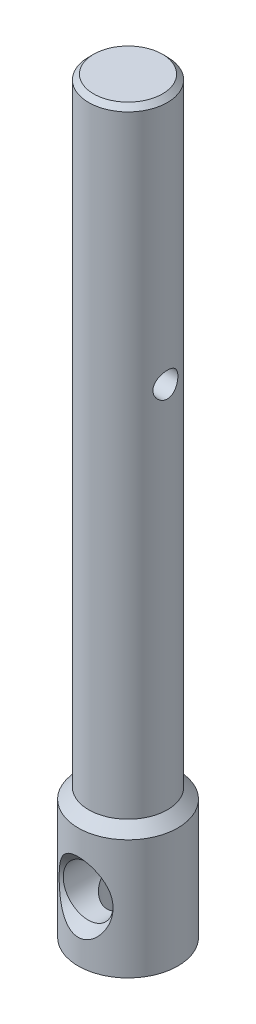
ISO-10303-21;
HEADER;
FILE_DESCRIPTION(('STEP AP214'),'2;1');
FILE_NAME('part.step','',(''),(''),'','','');
FILE_SCHEMA(('AUTOMOTIVE_DESIGN { 1 0 10303 214 1 1 1 1 }'));
ENDSEC;
DATA;
#1=APPLICATION_CONTEXT('core data for automotive mechanical design processes');
#2=APPLICATION_PROTOCOL_DEFINITION('international standard','automotive_design',2000,#1);
#3=PRODUCT_CONTEXT('',#1,'mechanical');
#4=PRODUCT('Part','Part','',(#3));
#5=PRODUCT_RELATED_PRODUCT_CATEGORY('part','',(#4));
#6=PRODUCT_DEFINITION_FORMATION('','',#4);
#7=PRODUCT_DEFINITION_CONTEXT('part definition',#1,'design');
#8=PRODUCT_DEFINITION('design','',#6,#7);
#9=PRODUCT_DEFINITION_SHAPE('','',#8);
#10=(LENGTH_UNIT() NAMED_UNIT(*) SI_UNIT(.MILLI.,.METRE.));
#11=(NAMED_UNIT(*) PLANE_ANGLE_UNIT() SI_UNIT($,.RADIAN.));
#12=(NAMED_UNIT(*) SI_UNIT($,.STERADIAN.) SOLID_ANGLE_UNIT());
#13=UNCERTAINTY_MEASURE_WITH_UNIT(LENGTH_MEASURE(1.E-05),#10,'distance_accuracy_value','');
#14=(GEOMETRIC_REPRESENTATION_CONTEXT(3) GLOBAL_UNCERTAINTY_ASSIGNED_CONTEXT((#13)) GLOBAL_UNIT_ASSIGNED_CONTEXT((#10,
#11,#12)) REPRESENTATION_CONTEXT('',''));
#15=CARTESIAN_POINT('',(0.,0.,0.));
#16=DIRECTION('',(0.,0.,1.));
#17=DIRECTION('',(1.,0.,0.));
#18=AXIS2_PLACEMENT_3D('',#15,#16,#17);
#19=CARTESIAN_POINT('',(0.,0.,0.));
#20=DIRECTION('',(0.,1.,0.));
#21=DIRECTION('',(0.,0.,1.));
#22=AXIS2_PLACEMENT_3D('',#19,#20,#21);
#23=PLANE('',#22);
#24=CARTESIAN_POINT('',(0.,0.,0.));
#25=DIRECTION('',(0.,-1.,0.));
#26=DIRECTION('',(0.,0.,-1.));
#27=AXIS2_PLACEMENT_3D('',#24,#25,#26);
#28=CIRCLE('',#27,5.);
#29=CARTESIAN_POINT('',(0.,0.,-5.));
#30=VERTEX_POINT('',#29);
#31=EDGE_CURVE('E85',#30,#30,#28,.T.);
#32=ORIENTED_EDGE('',*,*,#31,.T.);
#33=EDGE_LOOP('',(#32));
#34=FACE_BOUND('',#33,.T.);
#35=CARTESIAN_POINT('',(0.,0.,0.));
#36=DIRECTION('',(0.,-1.,0.));
#37=DIRECTION('',(0.,0.,-1.));
#38=AXIS2_PLACEMENT_3D('',#35,#36,#37);
#39=CIRCLE('',#38,2.09999999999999);
#40=CARTESIAN_POINT('',(0.,0.,-2.09999999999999));
#41=VERTEX_POINT('',#40);
#42=EDGE_CURVE('E69',#41,#41,#39,.T.);
#43=ORIENTED_EDGE('',*,*,#42,.F.);
#44=EDGE_LOOP('',(#43));
#45=FACE_BOUND('',#44,.T.);
#46=ADVANCED_FACE('F43',(#34,#45),#23,.F.);
#47=CARTESIAN_POINT('',(0.,0.,0.));
#48=DIRECTION('',(0.,-1.,0.));
#49=DIRECTION('',(0.,0.,-1.));
#50=AXIS2_PLACEMENT_3D('',#47,#48,#49);
#51=CYLINDRICAL_SURFACE('',#50,5.);
#52=CARTESIAN_POINT('',(-2.04163136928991,3.7150619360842,-4.56418024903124));
#53=CARTESIAN_POINT('',(-2.15834877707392,3.88935210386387,-4.51197567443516));
#54=CARTESIAN_POINT('',(-2.25954266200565,4.07465214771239,-4.46137897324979));
#55=CARTESIAN_POINT('',(-2.43157280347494,4.46145756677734,-4.37001026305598));
#56=CARTESIAN_POINT('',(-2.5023525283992,4.66299229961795,-4.3292566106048));
#57=CARTESIAN_POINT('',(-2.58559109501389,4.97395121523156,-4.27968824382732));
#58=CARTESIAN_POINT('',(-2.6095662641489,5.07950064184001,-4.26505635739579));
#59=CARTESIAN_POINT('',(-2.64960604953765,5.29259640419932,-4.24030116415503));
#60=CARTESIAN_POINT('',(-2.66567369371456,5.40014195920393,-4.23017613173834));
#61=CARTESIAN_POINT('',(-2.68981267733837,5.61636003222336,-4.2148677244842));
#62=CARTESIAN_POINT('',(-2.69789217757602,5.72503128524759,-4.20967930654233));
#63=CARTESIAN_POINT('',(-2.70603661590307,5.94279720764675,-4.20444890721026));
#64=CARTESIAN_POINT('',(-2.70610181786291,6.05189186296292,-4.20440675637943));
#65=CARTESIAN_POINT('',(-2.69830455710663,6.26726388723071,-4.20941471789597));
#66=CARTESIAN_POINT('',(-2.69061705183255,6.37355028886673,-4.21435244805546));
#67=CARTESIAN_POINT('',(-2.66762262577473,6.58496519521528,-4.22894474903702));
#68=CARTESIAN_POINT('',(-2.65231565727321,6.69009369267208,-4.23859934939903));
#69=CARTESIAN_POINT('',(-2.61413520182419,6.89857712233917,-4.26225327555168));
#70=CARTESIAN_POINT('',(-2.59125461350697,7.00193029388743,-4.2762566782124));
#71=CARTESIAN_POINT('',(-2.53800564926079,7.20610268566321,-4.30807143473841));
#72=CARTESIAN_POINT('',(-2.50763443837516,7.30692093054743,-4.32588422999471));
#73=CARTESIAN_POINT('',(-2.40468658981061,7.60659915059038,-4.38449877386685));
#74=CARTESIAN_POINT('',(-2.32063374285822,7.80070607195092,-4.4302336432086));
#75=CARTESIAN_POINT('',(-2.12205531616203,8.17061846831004,-4.52870122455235));
#76=CARTESIAN_POINT('',(-2.00755558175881,8.34643929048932,-4.58142798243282));
#77=CARTESIAN_POINT('',(-1.78164962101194,8.62969628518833,-4.67293984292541));
#78=CARTESIAN_POINT('',(-1.67747535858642,8.74290263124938,-4.7117140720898));
#79=CARTESIAN_POINT('',(-1.45178944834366,8.95172314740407,-4.78605945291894));
#80=CARTESIAN_POINT('',(-1.33030905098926,9.04736833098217,-4.82163619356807));
#81=CARTESIAN_POINT('',(-1.09918657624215,9.19718724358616,-4.87879781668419));
#82=CARTESIAN_POINT('',(-0.99280972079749,9.25585560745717,-4.90173939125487));
#83=CARTESIAN_POINT('',(-0.771144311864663,9.35608578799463,-4.94145451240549));
#84=CARTESIAN_POINT('',(-0.655862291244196,9.39766000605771,-4.95823252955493));
#85=CARTESIAN_POINT('',(-0.418028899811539,9.46094716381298,-4.9839381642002));
#86=CARTESIAN_POINT('',(-0.295427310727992,9.48250066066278,-4.99280273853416));
#87=CARTESIAN_POINT('',(-0.0480419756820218,9.50316033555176,-5.0012969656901));
#88=CARTESIAN_POINT('',(0.0767403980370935,9.50228015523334,-5.0009322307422));
#89=CARTESIAN_POINT('',(0.308404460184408,9.47971270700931,-4.99165917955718));
#90=CARTESIAN_POINT('',(0.415594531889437,9.46060713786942,-4.9838109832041));
#91=CARTESIAN_POINT('',(0.625236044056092,9.40665046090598,-4.96187510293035));
#92=CARTESIAN_POINT('',(0.727685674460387,9.37179339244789,-4.94778505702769));
#93=CARTESIAN_POINT('',(0.953679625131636,9.27663730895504,-4.9098922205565));
#94=CARTESIAN_POINT('',(1.07509872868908,9.21194739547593,-4.88447453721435));
#95=CARTESIAN_POINT('',(1.30503445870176,9.06453402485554,-4.82814438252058));
#96=CARTESIAN_POINT('',(1.41352625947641,8.98177670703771,-4.79722161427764));
#97=CARTESIAN_POINT('',(1.65141008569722,8.77173068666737,-4.72157414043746));
#98=CARTESIAN_POINT('',(1.77548105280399,8.63884290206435,-4.67571587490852));
#99=CARTESIAN_POINT('',(1.99994383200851,8.35443240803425,-4.58420674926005));
#100=CARTESIAN_POINT('',(2.1003084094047,8.20288856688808,-4.53855618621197));
#101=CARTESIAN_POINT('',(2.28012888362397,7.88200283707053,-4.45098071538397));
#102=CARTESIAN_POINT('',(2.35904236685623,7.71232820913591,-4.40916757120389));
#103=CARTESIAN_POINT('',(2.49303182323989,7.36188827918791,-4.33482328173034));
#104=CARTESIAN_POINT('',(2.54811448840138,7.18112610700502,-4.30228953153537));
#105=CARTESIAN_POINT('',(2.61589500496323,6.89054070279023,-4.26120893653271));
#106=CARTESIAN_POINT('',(2.63666162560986,6.78313321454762,-4.24834030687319));
#107=CARTESIAN_POINT('',(2.67012149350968,6.56657296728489,-4.22739287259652));
#108=CARTESIAN_POINT('',(2.68281410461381,6.45742007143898,-4.21931444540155));
#109=CARTESIAN_POINT('',(2.70004351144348,6.23824121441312,-4.20830941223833));
#110=CARTESIAN_POINT('',(2.70458206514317,6.12821544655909,-4.20538169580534));
#111=CARTESIAN_POINT('',(2.70548116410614,5.9081197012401,-4.20480354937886));
#112=CARTESIAN_POINT('',(2.70184212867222,5.79804972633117,-4.20715284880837));
#113=CARTESIAN_POINT('',(2.6866874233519,5.58265750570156,-4.21684557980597));
#114=CARTESIAN_POINT('',(2.67545904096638,5.47730660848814,-4.22400680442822));
#115=CARTESIAN_POINT('',(2.64547849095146,5.26805358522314,-4.24284761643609));
#116=CARTESIAN_POINT('',(2.62672349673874,5.16415201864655,-4.25452890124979));
#117=CARTESIAN_POINT('',(2.58174852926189,4.95844473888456,-4.28197033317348));
#118=CARTESIAN_POINT('',(2.55552328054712,4.85664056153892,-4.2977333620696));
#119=CARTESIAN_POINT('',(2.49567830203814,4.65583387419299,-4.33275692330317));
#120=CARTESIAN_POINT('',(2.46205579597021,4.55683243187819,-4.35201876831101));
#121=CARTESIAN_POINT('',(2.34855505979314,4.2607965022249,-4.41496879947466));
#122=CARTESIAN_POINT('',(2.25697230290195,4.06904843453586,-4.46320344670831));
#123=CARTESIAN_POINT('',(2.04274496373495,3.70551411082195,-4.56522008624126));
#124=CARTESIAN_POINT('',(1.9201401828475,3.53370268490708,-4.61899491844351));
#125=CARTESIAN_POINT('',(1.68487427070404,3.26558247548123,-4.70870120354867));
#126=CARTESIAN_POINT('',(1.58047477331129,3.16217838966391,-4.74509798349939));
#127=CARTESIAN_POINT('',(1.35591257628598,2.97264719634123,-4.81406670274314));
#128=CARTESIAN_POINT('',(1.23577776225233,2.88649019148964,-4.84664521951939));
#129=CARTESIAN_POINT('',(1.00646995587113,2.7516115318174,-4.89876537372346));
#130=CARTESIAN_POINT('',(0.899988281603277,2.69884323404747,-4.91961111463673));
#131=CARTESIAN_POINT('',(0.679091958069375,2.61043320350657,-4.95492713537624));
#132=CARTESIAN_POINT('',(0.564683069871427,2.57477917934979,-4.96940199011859));
#133=CARTESIAN_POINT('',(0.329913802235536,2.52304964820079,-4.99050246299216));
#134=CARTESIAN_POINT('',(0.209518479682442,2.50710784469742,-4.99707446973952));
#135=CARTESIAN_POINT('',(-0.0323400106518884,2.49670505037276,-5.00135579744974));
#136=CARTESIAN_POINT('',(-0.153802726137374,2.50223536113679,-4.9990687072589));
#137=CARTESIAN_POINT('',(-0.380598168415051,2.53250553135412,-4.98664954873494));
#138=CARTESIAN_POINT('',(-0.486271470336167,2.55513766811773,-4.97737857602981));
#139=CARTESIAN_POINT('',(-0.692458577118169,2.61555268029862,-4.9529082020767));
#140=CARTESIAN_POINT('',(-0.792969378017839,2.65334426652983,-4.93770539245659));
#141=CARTESIAN_POINT('',(-1.0183803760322,2.75633132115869,-4.89692827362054));
#142=CARTESIAN_POINT('',(-1.14071424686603,2.82643233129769,-4.86959065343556));
#143=CARTESIAN_POINT('',(-1.37152468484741,2.98474135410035,-4.80969938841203));
#144=CARTESIAN_POINT('',(-1.47998405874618,3.07297148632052,-4.77713938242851));
#145=CARTESIAN_POINT('',(-1.66846180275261,3.25019014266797,-4.71430483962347));
#146=CARTESIAN_POINT('',(-1.75033635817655,3.337346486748,-4.68434762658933));
#147=CARTESIAN_POINT('',(-1.90369368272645,3.52016737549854,-4.62414658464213));
#148=CARTESIAN_POINT('',(-1.97517855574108,3.61583019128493,-4.5939028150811));
#149=CARTESIAN_POINT('',(-2.04163136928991,3.7150619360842,-4.56418024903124));
#150=B_SPLINE_CURVE_WITH_KNOTS('',3,(#52,#53,#54,#55,#56,#57,#58,#59,#60,#61,#62,#63,#64,#65,
#66,#67,#68,#69,#70,#71,#72,#73,#74,#75,#76,#77,#78,#79,#80,#81,#82,#83,#84,#85,#86,#87,#88,#89,
#90,#91,#92,#93,#94,#95,#96,#97,#98,#99,#100,#101,#102,#103,#104,#105,#106,#107,#108,#109,#110,
#111,#112,#113,#114,#115,#116,#117,#118,#119,#120,#121,#122,#123,#124,#125,#126,#127,#128,#129,
#130,#131,#132,#133,#134,#135,#136,#137,#138,#139,#140,#141,#142,#143,#144,#145,#146,#147,#148,
#149),.UNSPECIFIED.,.T.,.F.,(4,2,2,2,2,2,2,2,2,2,2,2,2,2,2,2,2,2,2,2,2,2,2,2,2,2,2,2,2,2,2,2,2,
2,2,2,2,2,2,2,2,2,2,2,2,2,2,2,4),(0.,0.64804458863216,1.29728855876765,1.62462305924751,
1.95183212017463,2.27870655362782,2.60557022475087,2.92521895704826,3.24486969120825,
3.56482099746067,3.88489358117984,4.53103621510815,5.17663210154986,5.65102181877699,
6.12456551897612,6.4940434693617,6.86325289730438,7.23537807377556,7.60727697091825,
7.93327114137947,8.25938877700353,8.67681646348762,9.09503328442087,9.65453396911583,
10.2146743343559,10.7878824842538,11.3609295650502,11.6910244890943,12.0211454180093,
12.351195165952,12.6812279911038,12.9994196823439,13.317730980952,13.6362676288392,
13.9549240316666,14.6054574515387,15.255160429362,15.7078183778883,16.1596847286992,
16.5202304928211,16.8805169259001,17.2432339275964,17.6058040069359,17.9297749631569,
18.2539323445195,18.6824551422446,19.1115039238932,19.4805415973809,19.849504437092),.UNSPECIFIED.);
#151=CARTESIAN_POINT('',(-2.04163136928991,3.7150619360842,-4.56418024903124));
#152=VERTEX_POINT('',#151);
#153=EDGE_CURVE('E88',#152,#152,#150,.T.);
#154=ORIENTED_EDGE('',*,*,#153,.F.);
#155=EDGE_LOOP('',(#154));
#156=FACE_BOUND('',#155,.T.);
#157=CARTESIAN_POINT('',(0.,12.,0.));
#158=DIRECTION('',(0.,-1.,0.));
#159=DIRECTION('',(0.,0.,-1.));
#160=AXIS2_PLACEMENT_3D('',#157,#158,#159);
#161=CIRCLE('',#160,5.);
#162=CARTESIAN_POINT('',(0.,12.,-5.));
#163=VERTEX_POINT('',#162);
#164=EDGE_CURVE('E82',#163,#163,#161,.T.);
#165=ORIENTED_EDGE('',*,*,#164,.T.);
#166=EDGE_LOOP('',(#165));
#167=FACE_BOUND('',#166,.T.);
#168=ORIENTED_EDGE('',*,*,#31,.F.);
#169=EDGE_LOOP('',(#168));
#170=FACE_BOUND('',#169,.T.);
#171=CARTESIAN_POINT('',(-2.04163136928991,3.7150619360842,4.56418024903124));
#172=CARTESIAN_POINT('',(-1.9599859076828,3.59312932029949,4.60070439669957));
#173=CARTESIAN_POINT('',(-1.87063178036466,3.47644884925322,4.63805560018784));
#174=CARTESIAN_POINT('',(-1.6760621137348,3.25644395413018,4.71186217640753));
#175=CARTESIAN_POINT('',(-1.5708278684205,3.15313555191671,4.74831643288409));
#176=CARTESIAN_POINT('',(-1.35827933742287,2.97551638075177,4.81309255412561));
#177=CARTESIAN_POINT('',(-1.25279079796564,2.89920477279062,4.84186382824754));
#178=CARTESIAN_POINT('',(-1.03021210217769,2.76357581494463,4.89404382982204));
#179=CARTESIAN_POINT('',(-0.913140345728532,2.7042320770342,4.9174608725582));
#180=CARTESIAN_POINT('',(-0.688079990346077,2.61392651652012,4.95352972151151));
#181=CARTESIAN_POINT('',(-0.581465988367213,2.58000242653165,4.96728361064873));
#182=CARTESIAN_POINT('',(-0.36358480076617,2.5292577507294,4.9879601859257));
#183=CARTESIAN_POINT('',(-0.25232050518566,2.51242670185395,4.99488705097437));
#184=CARTESIAN_POINT('',(-0.0279967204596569,2.49712105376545,5.00118329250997));
#185=CARTESIAN_POINT('',(0.0850668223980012,2.4986964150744,5.00053209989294));
#186=CARTESIAN_POINT('',(0.309128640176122,2.52019657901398,4.99169537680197));
#187=CARTESIAN_POINT('',(0.420126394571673,2.54012594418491,4.983507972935));
#188=CARTESIAN_POINT('',(0.632901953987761,2.5957734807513,4.96089476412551));
#189=CARTESIAN_POINT('',(0.734868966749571,2.63087974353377,4.94671116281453));
#190=CARTESIAN_POINT('',(0.932137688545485,2.71466876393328,4.91336433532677));
#191=CARTESIAN_POINT('',(1.027436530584,2.76335731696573,4.89419898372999));
#192=CARTESIAN_POINT('',(1.25185735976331,2.89689002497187,4.84267059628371));
#193=CARTESIAN_POINT('',(1.37671824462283,2.98811726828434,4.80826404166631));
#194=CARTESIAN_POINT('',(1.60927689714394,3.18908646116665,4.73552102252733));
#195=CARTESIAN_POINT('',(1.71693233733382,3.29887274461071,4.69717523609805));
#196=CARTESIAN_POINT('',(1.94603175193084,3.56903613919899,4.60786612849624));
#197=CARTESIAN_POINT('',(2.06135649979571,3.73453004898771,4.55668652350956));
#198=CARTESIAN_POINT('',(2.26364993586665,4.08329094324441,4.45964972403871));
#199=CARTESIAN_POINT('',(2.35060034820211,4.26656928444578,4.41379597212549));
#200=CARTESIAN_POINT('',(2.49748722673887,4.64880968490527,4.3324060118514));
#201=CARTESIAN_POINT('',(2.55705748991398,4.84794478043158,4.29701180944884));
#202=CARTESIAN_POINT('',(2.62449724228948,5.15284134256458,4.25589790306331));
#203=CARTESIAN_POINT('',(2.6433251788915,5.25551426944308,4.24418904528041));
#204=CARTESIAN_POINT('',(2.67362539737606,5.46233089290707,4.22516964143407));
#205=CARTESIAN_POINT('',(2.68510041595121,5.56647402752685,4.21785745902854));
#206=CARTESIAN_POINT('',(2.70091109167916,5.77921537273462,4.207751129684));
#207=CARTESIAN_POINT('',(2.70498108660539,5.88784131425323,4.2051251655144));
#208=CARTESIAN_POINT('',(2.70515359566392,6.10510479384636,4.20501411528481));
#209=CARTESIAN_POINT('',(2.70125585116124,6.21374233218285,4.20752919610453));
#210=CARTESIAN_POINT('',(2.68551041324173,6.43026235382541,4.2175968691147));
#211=CARTESIAN_POINT('',(2.67365882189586,6.53814444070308,4.22515193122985));
#212=CARTESIAN_POINT('',(2.64207603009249,6.7522800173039,4.24496984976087));
#213=CARTESIAN_POINT('',(2.62234492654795,6.85853352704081,4.25723264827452));
#214=CARTESIAN_POINT('',(2.5526366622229,7.16847309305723,4.29965560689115));
#215=CARTESIAN_POINT('',(2.49172006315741,7.3690143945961,4.33576079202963));
#216=CARTESIAN_POINT('',(2.34062516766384,7.75627318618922,4.41914866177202));
#217=CARTESIAN_POINT('',(2.25043859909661,7.94298674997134,4.4664345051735));
#218=CARTESIAN_POINT('',(2.05503919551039,8.27276942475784,4.55925780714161));
#219=CARTESIAN_POINT('',(1.95366008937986,8.41829708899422,4.60412394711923));
#220=CARTESIAN_POINT('',(1.72822091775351,8.69075619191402,4.69338928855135));
#221=CARTESIAN_POINT('',(1.60419965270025,8.817718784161,4.7377891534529));
#222=CARTESIAN_POINT('',(1.369170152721,9.01622100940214,4.81001125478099));
#223=CARTESIAN_POINT('',(1.26343683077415,9.09352862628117,4.83910673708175));
#224=CARTESIAN_POINT('',(1.04015030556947,9.23107617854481,4.89195109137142));
#225=CARTESIAN_POINT('',(0.922613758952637,9.29133972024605,4.91570734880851));
#226=CARTESIAN_POINT('',(0.69705161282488,9.38296087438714,4.95227471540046));
#227=CARTESIAN_POINT('',(0.590464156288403,9.41738358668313,4.96622293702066));
#228=CARTESIAN_POINT('',(0.372549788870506,9.46913041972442,4.98729926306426));
#229=CARTESIAN_POINT('',(0.261226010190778,9.48646566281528,4.99443180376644));
#230=CARTESIAN_POINT('',(0.0366726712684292,9.5027504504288,5.00113003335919));
#231=CARTESIAN_POINT('',(-0.0765614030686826,9.50164764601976,5.00067417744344));
#232=CARTESIAN_POINT('',(-0.301043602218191,9.48101802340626,4.99219400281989));
#233=CARTESIAN_POINT('',(-0.412291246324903,9.46148680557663,4.98416787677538));
#234=CARTESIAN_POINT('',(-0.625387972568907,9.40658283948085,4.96184831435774));
#235=CARTESIAN_POINT('',(-0.727434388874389,9.37185756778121,4.9478114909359));
#236=CARTESIAN_POINT('',(-0.924906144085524,9.28879394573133,4.91473233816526));
#237=CARTESIAN_POINT('',(-1.02032863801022,9.24044979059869,4.89568787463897));
#238=CARTESIAN_POINT('',(-1.24476111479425,9.10790625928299,4.84449457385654));
#239=CARTESIAN_POINT('',(-1.3695639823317,9.01736149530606,4.81030515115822));
#240=CARTESIAN_POINT('',(-1.60211412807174,8.81776858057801,4.7379475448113));
#241=CARTESIAN_POINT('',(-1.70981955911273,8.70867634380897,4.69976996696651));
#242=CARTESIAN_POINT('',(-1.93928436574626,8.43995466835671,4.61071617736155));
#243=CARTESIAN_POINT('',(-2.0549264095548,8.27518294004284,4.55959805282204));
#244=CARTESIAN_POINT('',(-2.25795380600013,7.92782438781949,4.46254494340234));
#245=CARTESIAN_POINT('',(-2.3453197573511,7.74522544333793,4.41661353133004));
#246=CARTESIAN_POINT('',(-2.49318108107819,7.36423913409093,4.33489559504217));
#247=CARTESIAN_POINT('',(-2.55330149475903,7.16567328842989,4.29925295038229));
#248=CARTESIAN_POINT('',(-2.62164286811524,6.86157646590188,4.25765897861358));
#249=CARTESIAN_POINT('',(-2.64078351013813,6.75916876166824,4.24577261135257));
#250=CARTESIAN_POINT('',(-2.67173795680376,6.55285474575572,4.22636499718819));
#251=CARTESIAN_POINT('',(-2.68355447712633,6.44894900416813,4.21884213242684));
#252=CARTESIAN_POINT('',(-2.70010517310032,6.23644411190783,4.20826940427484));
#253=CARTESIAN_POINT('',(-2.70455910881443,6.12781431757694,4.20539661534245));
#254=CARTESIAN_POINT('',(-2.70549580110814,5.91050232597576,4.20479398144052));
#255=CARTESIAN_POINT('',(-2.70197823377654,5.80182012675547,4.20706434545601));
#256=CARTESIAN_POINT('',(-2.68698222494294,5.5850944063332,4.21665841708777));
#257=CARTESIAN_POINT('',(-2.67549410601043,5.4770518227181,4.22398826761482));
#258=CARTESIAN_POINT('',(-2.64461828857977,5.26256303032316,4.2433846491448));
#259=CARTESIAN_POINT('',(-2.62523091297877,5.1561167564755,4.25545098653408));
#260=CARTESIAN_POINT('',(-2.55650604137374,4.84553278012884,4.29734723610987));
#261=CARTESIAN_POINT('',(-2.49620388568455,4.64451668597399,4.33316954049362));
#262=CARTESIAN_POINT('',(-2.34643323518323,4.25670834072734,4.4160513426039));
#263=CARTESIAN_POINT('',(-2.25704481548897,4.06987875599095,4.46307989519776));
#264=CARTESIAN_POINT('',(-2.11760300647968,3.83231864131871,4.52960047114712));
#265=CARTESIAN_POINT('',(-2.08049029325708,3.77309541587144,4.54679668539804));
#266=CARTESIAN_POINT('',(-2.04163136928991,3.7150619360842,4.56418024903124));
#267=B_SPLINE_CURVE_WITH_KNOTS('',3,(#171,#172,#173,#174,#175,#176,#177,#178,#179,#180,#181,
#182,#183,#184,#185,#186,#187,#188,#189,#190,#191,#192,#193,#194,#195,#196,#197,#198,#199,#200,
#201,#202,#203,#204,#205,#206,#207,#208,#209,#210,#211,#212,#213,#214,#215,#216,#217,#218,#219,
#220,#221,#222,#223,#224,#225,#226,#227,#228,#229,#230,#231,#232,#233,#234,#235,#236,#237,#238,
#239,#240,#241,#242,#243,#244,#245,#246,#247,#248,#249,#250,#251,#252,#253,#254,#255,#256,#257,
#258,#259,#260,#261,#262,#263,#264,#265,#266),.UNSPECIFIED.,.T.,.F.,(4,2,2,2,2,2,2,2,2,2,2,2,2,
2,2,2,2,2,2,2,2,2,2,2,2,2,2,2,2,2,2,2,2,2,2,2,2,2,2,2,2,2,2,2,2,2,2,4),(0.,0.453541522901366,
0.907621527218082,1.30621100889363,1.70417719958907,2.04090191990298,2.37742039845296,
2.71485250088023,3.0523685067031,3.37738782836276,3.70254604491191,4.17516675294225,
4.64893283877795,5.26999489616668,5.89145619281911,6.52100343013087,6.83582717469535,
7.15053367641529,7.47632333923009,7.80212357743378,8.12808359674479,8.45403960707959,
9.08906568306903,9.72427138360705,10.2711425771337,10.8170852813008,11.2182085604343,
11.6187735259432,11.9559523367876,12.2929115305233,12.6308275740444,12.9688243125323,
13.2936401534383,13.6185946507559,14.0897689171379,14.5620792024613,15.1819073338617,
15.8021598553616,16.4307068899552,16.7449849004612,17.0591463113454,17.3850112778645,
17.7108894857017,18.0371640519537,18.3634252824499,18.9991994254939,19.6332378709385,
19.8490996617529),.UNSPECIFIED.);
#268=CARTESIAN_POINT('',(-2.04163136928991,3.7150619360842,4.56418024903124));
#269=VERTEX_POINT('',#268);
#270=EDGE_CURVE('E95',#269,#269,#267,.T.);
#271=ORIENTED_EDGE('',*,*,#270,.F.);
#272=EDGE_LOOP('',(#271));
#273=FACE_BOUND('',#272,.T.);
#274=ADVANCED_FACE('F100',(#156,#167,#170,#273),#51,.T.);
#275=CARTESIAN_POINT('',(0.,13.05,0.));
#276=DIRECTION('',(0.,-1.,0.));
#277=DIRECTION('',(0.,0.,-1.));
#278=AXIS2_PLACEMENT_3D('',#275,#276,#277);
#279=CONICAL_SURFACE('',#278,3.95,0.78539816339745);
#280=ORIENTED_EDGE('',*,*,#164,.F.);
#281=EDGE_LOOP('',(#280));
#282=FACE_BOUND('',#281,.T.);
#283=CARTESIAN_POINT('',(0.,13.05,0.));
#284=DIRECTION('',(0.,-1.,0.));
#285=DIRECTION('',(0.,0.,-1.));
#286=AXIS2_PLACEMENT_3D('',#283,#284,#285);
#287=CIRCLE('',#286,3.95);
#288=CARTESIAN_POINT('',(0.,13.05,-3.95));
#289=VERTEX_POINT('',#288);
#290=EDGE_CURVE('E79',#289,#289,#287,.T.);
#291=ORIENTED_EDGE('',*,*,#290,.T.);
#292=EDGE_LOOP('',(#291));
#293=FACE_BOUND('',#292,.T.);
#294=ADVANCED_FACE('F124',(#282,#293),#279,.T.);
#295=CARTESIAN_POINT('',(0.,0.,0.));
#296=DIRECTION('',(0.,-1.,0.));
#297=DIRECTION('',(0.,0.,-1.));
#298=AXIS2_PLACEMENT_3D('',#295,#296,#297);
#299=CYLINDRICAL_SURFACE('',#298,3.95);
#300=CARTESIAN_POINT('',(0.,74.5,0.));
#301=DIRECTION('',(0.,-1.,0.));
#302=DIRECTION('',(0.,0.,-1.));
#303=AXIS2_PLACEMENT_3D('',#300,#301,#302);
#304=CIRCLE('',#303,3.95);
#305=CARTESIAN_POINT('',(0.,74.5,-3.95));
#306=VERTEX_POINT('',#305);
#307=EDGE_CURVE('E50',#306,#306,#304,.T.);
#308=ORIENTED_EDGE('',*,*,#307,.T.);
#309=EDGE_LOOP('',(#308));
#310=FACE_BOUND('',#309,.T.);
#311=CARTESIAN_POINT('',(3.74699879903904,50.,-1.25));
#312=CARTESIAN_POINT('',(3.74699911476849,49.9317012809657,-1.24999967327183));
#313=CARTESIAN_POINT('',(3.74888660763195,49.8633990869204,-1.24438335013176));
#314=CARTESIAN_POINT('',(3.75619819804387,49.7288044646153,-1.2221328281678));
#315=CARTESIAN_POINT('',(3.76162317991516,49.6625125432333,-1.2054958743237));
#316=CARTESIAN_POINT('',(3.77533509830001,49.5339079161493,-1.16183594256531));
#317=CARTESIAN_POINT('',(3.78361686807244,49.4715882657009,-1.13483170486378));
#318=CARTESIAN_POINT('',(3.80210197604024,49.3523460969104,-1.07126657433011));
#319=CARTESIAN_POINT('',(3.81230566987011,49.2954245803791,-1.03470391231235));
#320=CARTESIAN_POINT('',(3.83388814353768,49.1865889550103,-0.951680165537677));
#321=CARTESIAN_POINT('',(3.84529405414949,49.1348929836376,-0.904940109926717));
#322=CARTESIAN_POINT('',(3.86776523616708,49.0399265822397,-0.803485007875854));
#323=CARTESIAN_POINT('',(3.87883045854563,48.9966573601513,-0.74876882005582));
#324=CARTESIAN_POINT('',(3.89968455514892,48.9188051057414,-0.631341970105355));
#325=CARTESIAN_POINT('',(3.9094377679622,48.8844474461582,-0.568474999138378));
#326=CARTESIAN_POINT('',(3.92625157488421,48.8268788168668,-0.437493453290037));
#327=CARTESIAN_POINT('',(3.93331281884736,48.8036651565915,-0.369380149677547));
#328=CARTESIAN_POINT('',(3.94375501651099,48.7697739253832,-0.232124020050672));
#329=CARTESIAN_POINT('',(3.94724522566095,48.7587233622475,-0.163081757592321));
#330=CARTESIAN_POINT('',(3.95053833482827,48.7482894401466,-0.0240407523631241));
#331=CARTESIAN_POINT('',(3.95034209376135,48.7489033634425,0.0459577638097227));
#332=CARTESIAN_POINT('',(3.94636011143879,48.7615372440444,0.182296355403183));
#333=CARTESIAN_POINT('',(3.94270166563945,48.7731527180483,0.248678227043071));
#334=CARTESIAN_POINT('',(3.93236350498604,48.8067953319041,0.378496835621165));
#335=CARTESIAN_POINT('',(3.92568359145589,48.8288231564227,0.441933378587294));
#336=CARTESIAN_POINT('',(3.90988381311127,48.8829206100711,0.564984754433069));
#337=CARTESIAN_POINT('',(3.90073467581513,48.9151115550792,0.624542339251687));
#338=CARTESIAN_POINT('',(3.8809582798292,48.9885236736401,0.737535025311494));
#339=CARTESIAN_POINT('',(3.87033064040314,49.0297471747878,0.790968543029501));
#340=CARTESIAN_POINT('',(3.8481910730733,49.122123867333,0.892607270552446));
#341=CARTESIAN_POINT('',(3.83666076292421,49.173625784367,0.940491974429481));
#342=CARTESIAN_POINT('',(3.81440519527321,49.2840349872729,1.02704194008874));
#343=CARTESIAN_POINT('',(3.80368003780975,49.3429431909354,1.0657060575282));
#344=CARTESIAN_POINT('',(3.78415488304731,49.4674185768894,1.13310305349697));
#345=CARTESIAN_POINT('',(3.77537892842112,49.5330557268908,1.16171419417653));
#346=CARTESIAN_POINT('',(3.76102704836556,49.668561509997,1.2073752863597));
#347=CARTESIAN_POINT('',(3.75544993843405,49.7384285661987,1.22442951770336));
#348=CARTESIAN_POINT('',(3.74839108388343,49.8773337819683,1.24586804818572));
#349=CARTESIAN_POINT('',(3.74675043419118,49.9462879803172,1.25074429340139));
#350=CARTESIAN_POINT('',(3.7473085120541,50.0840351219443,1.2490718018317));
#351=CARTESIAN_POINT('',(3.74950662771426,50.1528280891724,1.24252488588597));
#352=CARTESIAN_POINT('',(3.75733738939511,50.2861601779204,1.21863202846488));
#353=CARTESIAN_POINT('',(3.76286539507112,50.3507649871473,1.20161477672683));
#354=CARTESIAN_POINT('',(3.77662141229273,50.4761940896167,1.15765178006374));
#355=CARTESIAN_POINT('',(3.78484987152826,50.5370177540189,1.13070438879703));
#356=CARTESIAN_POINT('',(3.80337840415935,50.6551279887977,1.06674693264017));
#357=CARTESIAN_POINT('',(3.813732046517,50.7122589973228,1.02946551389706));
#358=CARTESIAN_POINT('',(3.83523475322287,50.8196330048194,0.946213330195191));
#359=CARTESIAN_POINT('',(3.84638402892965,50.869874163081,0.900240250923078));
#360=CARTESIAN_POINT('',(3.86879728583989,50.9642541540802,0.798577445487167));
#361=CARTESIAN_POINT('',(3.88004586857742,51.0080412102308,0.742556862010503));
#362=CARTESIAN_POINT('',(3.90091612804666,51.085608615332,0.623689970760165));
#363=CARTESIAN_POINT('',(3.91053787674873,51.1193894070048,0.560843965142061));
#364=CARTESIAN_POINT('',(3.92701695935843,51.1756630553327,0.43048569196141));
#365=CARTESIAN_POINT('',(3.93389394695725,51.1982364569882,0.363010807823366));
#366=CARTESIAN_POINT('',(3.94419489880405,51.2316367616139,0.224965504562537));
#367=CARTESIAN_POINT('',(3.94761997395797,51.2424674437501,0.154396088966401));
#368=CARTESIAN_POINT('',(3.95055566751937,51.2517616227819,0.0153991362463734));
#369=CARTESIAN_POINT('',(3.95022692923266,51.2507326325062,-0.052991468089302));
#370=CARTESIAN_POINT('',(3.94607870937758,51.2375685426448,-0.188581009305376));
#371=CARTESIAN_POINT('',(3.94225946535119,51.2254341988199,-0.255780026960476));
#372=CARTESIAN_POINT('',(3.93161175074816,51.1907297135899,-0.38621116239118));
#373=CARTESIAN_POINT('',(3.92482337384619,51.16829842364,-0.449483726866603));
#374=CARTESIAN_POINT('',(3.90893709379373,51.1137627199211,-0.57139674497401));
#375=CARTESIAN_POINT('',(3.89983878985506,51.0816566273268,-0.630036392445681));
#376=CARTESIAN_POINT('',(3.8798890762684,51.0074022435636,-0.743221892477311));
#377=CARTESIAN_POINT('',(3.86898800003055,50.9649456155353,-0.797556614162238));
#378=CARTESIAN_POINT('',(3.84680085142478,50.8717355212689,-0.898498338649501));
#379=CARTESIAN_POINT('',(3.83551466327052,50.8209795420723,-0.945102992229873));
#380=CARTESIAN_POINT('',(3.81337537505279,50.710530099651,-1.03087364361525));
#381=CARTESIAN_POINT('',(3.80255032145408,50.6505901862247,-1.06973042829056));
#382=CARTESIAN_POINT('',(3.783048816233,50.5247030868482,-1.13677942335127));
#383=CARTESIAN_POINT('',(3.7743715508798,50.4587581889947,-1.1649756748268));
#384=CARTESIAN_POINT('',(3.76081067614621,50.3280067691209,-1.20800385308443));
#385=CARTESIAN_POINT('',(3.75568435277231,50.2635111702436,-1.22370518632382));
#386=CARTESIAN_POINT('',(3.74877870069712,50.1326778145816,-1.24470205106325));
#387=CARTESIAN_POINT('',(3.74699849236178,50.0663405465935,-1.25000031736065));
#388=CARTESIAN_POINT('',(3.74699879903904,50.,-1.25));
#389=B_SPLINE_CURVE_WITH_KNOTS('',3,(#311,#312,#313,#314,#315,#316,#317,#318,#319,#320,#321,
#322,#323,#324,#325,#326,#327,#328,#329,#330,#331,#332,#333,#334,#335,#336,#337,#338,#339,#340,
#341,#342,#343,#344,#345,#346,#347,#348,#349,#350,#351,#352,#353,#354,#355,#356,#357,#358,#359,
#360,#361,#362,#363,#364,#365,#366,#367,#368,#369,#370,#371,#372,#373,#374,#375,#376,#377,#378,
#379,#380,#381,#382,#383,#384,#385,#386,#387,#388),.UNSPECIFIED.,.T.,.F.,(4,2,2,2,2,2,2,2,2,2,2,
2,2,2,2,2,2,2,2,2,2,2,2,2,2,2,2,2,2,2,2,2,2,2,2,2,2,2,4),(0.,0.204650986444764,
0.409353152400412,0.613687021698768,0.818058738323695,1.02896119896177,1.23989386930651,
1.4557312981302,1.6715165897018,1.88048244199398,2.08939960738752,2.2909221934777,
2.49245803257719,2.69649683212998,2.90058827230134,3.11339092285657,3.32621997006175,
3.54154401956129,3.75678828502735,3.96318562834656,4.16955007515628,4.36974522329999,
4.56997357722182,4.77606039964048,4.98220217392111,5.19713832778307,5.4120649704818,
5.62542377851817,5.83871390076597,6.04291179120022,6.24709578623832,6.4486038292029,
6.6501468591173,6.85864557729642,7.06720754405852,7.28290822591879,7.49852705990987,
7.69736283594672,7.8961463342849),.UNSPECIFIED.);
#390=CARTESIAN_POINT('',(3.74699879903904,50.,-1.25));
#391=VERTEX_POINT('',#390);
#392=EDGE_CURVE('E126',#391,#391,#389,.T.);
#393=ORIENTED_EDGE('',*,*,#392,.T.);
#394=EDGE_LOOP('',(#393));
#395=FACE_BOUND('',#394,.T.);
#396=ORIENTED_EDGE('',*,*,#290,.F.);
#397=EDGE_LOOP('',(#396));
#398=FACE_BOUND('',#397,.T.);
#399=ADVANCED_FACE('F120',(#310,#395,#398),#299,.T.);
#400=CARTESIAN_POINT('',(-3.95,75.,0.));
#401=DIRECTION('',(0.,-1.,0.));
#402=DIRECTION('',(0.,0.,-1.));
#403=AXIS2_PLACEMENT_3D('',#400,#401,#402);
#404=PLANE('',#403);
#405=CARTESIAN_POINT('',(0.,75.,0.));
#406=DIRECTION('',(0.,-1.,0.));
#407=DIRECTION('',(0.,0.,-1.));
#408=AXIS2_PLACEMENT_3D('',#405,#406,#407);
#409=CIRCLE('',#408,3.45000000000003);
#410=CARTESIAN_POINT('',(0.,75.,-3.45000000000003));
#411=VERTEX_POINT('',#410);
#412=EDGE_CURVE('E11',#411,#411,#409,.F.);
#413=ORIENTED_EDGE('',*,*,#412,.T.);
#414=EDGE_LOOP('',(#413));
#415=FACE_BOUND('',#414,.T.);
#416=ADVANCED_FACE('F116',(#415),#404,.F.);
#417=CARTESIAN_POINT('',(0.,6.,4.));
#418=DIRECTION('',(0.,0.,1.));
#419=DIRECTION('',(1.,0.,0.));
#420=AXIS2_PLACEMENT_3D('',#417,#418,#419);
#421=CONICAL_SURFACE('',#420,2.5,0.785398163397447);
#422=CARTESIAN_POINT('',(0.,6.,4.));
#423=DIRECTION('',(0.,0.,1.));
#424=DIRECTION('',(1.,0.,0.));
#425=AXIS2_PLACEMENT_3D('',#422,#423,#424);
#426=CIRCLE('',#425,2.5);
#427=CARTESIAN_POINT('',(2.5,6.,4.));
#428=VERTEX_POINT('',#427);
#429=EDGE_CURVE('E66',#428,#428,#426,.T.);
#430=ORIENTED_EDGE('',*,*,#429,.F.);
#431=EDGE_LOOP('',(#430));
#432=FACE_BOUND('',#431,.T.);
#433=ORIENTED_EDGE('',*,*,#270,.T.);
#434=EDGE_LOOP('',(#433));
#435=FACE_BOUND('',#434,.T.);
#436=ADVANCED_FACE('F108',(#432,#435),#421,.F.);
#437=CARTESIAN_POINT('',(0.,6.,-5.));
#438=DIRECTION('',(0.,0.,-1.));
#439=DIRECTION('',(-1.,0.,0.));
#440=AXIS2_PLACEMENT_3D('',#437,#438,#439);
#441=CONICAL_SURFACE('',#440,3.5,0.785398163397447);
#442=CARTESIAN_POINT('',(0.,6.,-4.));
#443=DIRECTION('',(0.,0.,1.));
#444=DIRECTION('',(1.,0.,0.));
#445=AXIS2_PLACEMENT_3D('',#442,#443,#444);
#446=CIRCLE('',#445,2.5);
#447=CARTESIAN_POINT('',(2.5,6.,-4.));
#448=VERTEX_POINT('',#447);
#449=EDGE_CURVE('E62',#448,#448,#446,.T.);
#450=ORIENTED_EDGE('',*,*,#449,.T.);
#451=EDGE_LOOP('',(#450));
#452=FACE_BOUND('',#451,.T.);
#453=ORIENTED_EDGE('',*,*,#153,.T.);
#454=EDGE_LOOP('',(#453));
#455=FACE_BOUND('',#454,.T.);
#456=ADVANCED_FACE('F103',(#452,#455),#441,.F.);
#457=CARTESIAN_POINT('',(0.,6.,5.));
#458=DIRECTION('',(0.,0.,1.));
#459=DIRECTION('',(1.,0.,0.));
#460=AXIS2_PLACEMENT_3D('',#457,#458,#459);
#461=CYLINDRICAL_SURFACE('',#460,2.5);
#462=CARTESIAN_POINT('',(0.,3.5,-2.09999999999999));
#463=CARTESIAN_POINT('',(-0.0993730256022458,3.50000764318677,-2.09999218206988));
#464=CARTESIAN_POINT('',(-0.198894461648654,3.50598576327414,-2.09288501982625));
#465=CARTESIAN_POINT('',(-0.394712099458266,3.52937613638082,-2.06495473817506));
#466=CARTESIAN_POINT('',(-0.49100041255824,3.54681448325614,-2.04410031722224));
#467=CARTESIAN_POINT('',(-0.676934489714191,3.59150592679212,-1.99024330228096));
#468=CARTESIAN_POINT('',(-0.766619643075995,3.61869396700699,-1.95732120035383));
#469=CARTESIAN_POINT('',(-0.938364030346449,3.68098363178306,-1.8810418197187));
#470=CARTESIAN_POINT('',(-1.02042318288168,3.71608534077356,-1.83768442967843));
#471=CARTESIAN_POINT('',(-1.20508095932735,3.80639792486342,-1.72437703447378));
#472=CARTESIAN_POINT('',(-1.30400396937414,3.86423771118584,-1.65052906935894));
#473=CARTESIAN_POINT('',(-1.48564887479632,3.9863240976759,-1.48919024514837));
#474=CARTESIAN_POINT('',(-1.56832369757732,4.05058852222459,-1.40166102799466));
#475=CARTESIAN_POINT('',(-1.71877589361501,4.18178925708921,-1.21271884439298));
#476=CARTESIAN_POINT('',(-1.78623999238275,4.24875313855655,-1.11107346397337));
#477=CARTESIAN_POINT('',(-1.87423794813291,4.34496542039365,-0.94919914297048));
#478=CARTESIAN_POINT('',(-1.90135639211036,4.3763099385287,-0.893715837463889));
#479=CARTESIAN_POINT('',(-1.95101171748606,4.43633065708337,-0.779383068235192));
#480=CARTESIAN_POINT('',(-1.97355246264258,4.46500909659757,-0.72053649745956));
#481=CARTESIAN_POINT('',(-2.01536124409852,4.52026453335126,-0.594224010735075));
#482=CARTESIAN_POINT('',(-2.0342028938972,4.54647006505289,-0.526447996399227));
#483=CARTESIAN_POINT('',(-2.06527249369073,4.59096089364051,-0.386953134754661));
#484=CARTESIAN_POINT('',(-2.07751605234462,4.60926486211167,-0.315244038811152));
#485=CARTESIAN_POINT('',(-2.09459755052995,4.63511022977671,-0.167941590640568));
#486=CARTESIAN_POINT('',(-2.09933757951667,4.64250925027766,-0.092309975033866));
#487=CARTESIAN_POINT('',(-2.10053165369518,4.64435632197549,0.0591674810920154));
#488=CARTESIAN_POINT('',(-2.09698775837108,4.63880759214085,0.135013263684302));
#489=CARTESIAN_POINT('',(-2.08157225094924,4.61535287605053,0.288852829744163));
#490=CARTESIAN_POINT('',(-2.06917552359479,4.5966689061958,0.366666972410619));
#491=CARTESIAN_POINT('',(-2.03663853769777,4.54986113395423,0.517805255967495));
#492=CARTESIAN_POINT('',(-2.01647195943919,4.52170528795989,0.59111314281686));
#493=CARTESIAN_POINT('',(-1.97403882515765,4.46567448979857,0.718863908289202));
#494=CARTESIAN_POINT('',(-1.95296589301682,4.43883397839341,0.774180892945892));
#495=CARTESIAN_POINT('',(-1.90677427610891,4.38273781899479,0.88184018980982));
#496=CARTESIAN_POINT('',(-1.88165311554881,4.35348069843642,0.934180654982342));
#497=CARTESIAN_POINT('',(-1.8004572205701,4.26367122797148,1.08706358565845));
#498=CARTESIAN_POINT('',(-1.73857376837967,4.20111419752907,1.1833982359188));
#499=CARTESIAN_POINT('',(-1.59579178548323,4.07302449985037,1.37043234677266));
#500=CARTESIAN_POINT('',(-1.51398796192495,4.00753358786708,1.46046570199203));
#501=CARTESIAN_POINT('',(-1.3336214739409,3.88258555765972,1.62678562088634));
#502=CARTESIAN_POINT('',(-1.23509319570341,3.82311645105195,1.70309974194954));
#503=CARTESIAN_POINT('',(-1.04606866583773,3.72749738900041,1.82353247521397));
#504=CARTESIAN_POINT('',(-0.958857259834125,3.68912151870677,1.87102495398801));
#505=CARTESIAN_POINT('',(-0.77562966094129,3.62136303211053,1.95409663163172));
#506=CARTESIAN_POINT('',(-0.679618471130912,3.59197534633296,1.98968254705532));
#507=CARTESIAN_POINT('',(-0.479938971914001,3.54434014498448,2.04707692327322));
#508=CARTESIAN_POINT('',(-0.376214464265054,3.52618569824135,2.06877033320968));
#509=CARTESIAN_POINT('',(-0.165239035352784,3.50321794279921,2.09618202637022));
#510=CARTESIAN_POINT('',(-0.0579910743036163,3.49839371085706,2.1019133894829));
#511=CARTESIAN_POINT('',(0.141982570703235,3.5022935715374,2.09726852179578));
#512=CARTESIAN_POINT('',(0.234797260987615,3.509350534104,2.08887441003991));
#513=CARTESIAN_POINT('',(0.417235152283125,3.53334639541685,2.06020425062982));
#514=CARTESIAN_POINT('',(0.506858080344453,3.5502861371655,2.03992718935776));
#515=CARTESIAN_POINT('',(0.680859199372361,3.59282929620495,1.98863678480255));
#516=CARTESIAN_POINT('',(0.765231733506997,3.6184418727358,1.9576120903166));
#517=CARTESIAN_POINT('',(0.927287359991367,3.67673303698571,1.8862634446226));
#518=CARTESIAN_POINT('',(1.00496777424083,3.70941443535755,1.84593579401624));
#519=CARTESIAN_POINT('',(1.18582278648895,3.79594965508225,1.7376244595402));
#520=CARTESIAN_POINT('',(1.28500120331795,3.85276099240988,1.6653119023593));
#521=CARTESIAN_POINT('',(1.46741117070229,3.97300537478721,1.50710460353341));
#522=CARTESIAN_POINT('',(1.5505969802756,4.03645663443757,1.42117214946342));
#523=CARTESIAN_POINT('',(1.70228679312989,4.16634069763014,1.23565913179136));
#524=CARTESIAN_POINT('',(1.77049341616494,4.2328068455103,1.1358570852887));
#525=CARTESIAN_POINT('',(1.85989841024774,4.3288601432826,0.976959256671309));
#526=CARTESIAN_POINT('',(1.88753704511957,4.36025322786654,0.922494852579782));
#527=CARTESIAN_POINT('',(1.93835723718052,4.42065793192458,0.8102869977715));
#528=CARTESIAN_POINT('',(1.96154209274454,4.44967130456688,0.752546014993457));
#529=CARTESIAN_POINT('',(2.00546732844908,4.50683554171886,0.626905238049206));
#530=CARTESIAN_POINT('',(2.02564470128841,4.53452740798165,0.55859137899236));
#531=CARTESIAN_POINT('',(2.05928882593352,4.58219007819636,0.417788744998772));
#532=CARTESIAN_POINT('',(2.07277001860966,4.60217747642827,0.345309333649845));
#533=CARTESIAN_POINT('',(2.09220045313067,4.63141300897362,0.196005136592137));
#534=CARTESIAN_POINT('',(2.09804139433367,4.64050657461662,0.119133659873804));
#535=CARTESIAN_POINT('',(2.10111949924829,4.64526282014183,-0.0351824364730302));
#536=CARTESIAN_POINT('',(2.09836281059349,4.64093509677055,-0.112626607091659));
#537=CARTESIAN_POINT('',(2.08565152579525,4.62154129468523,-0.253628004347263));
#538=CARTESIAN_POINT('',(2.07682414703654,4.60816160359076,-0.317542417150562));
#539=CARTESIAN_POINT('',(2.05382763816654,4.57444317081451,-0.442533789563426));
#540=CARTESIAN_POINT('',(2.03965016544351,4.55409356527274,-0.503606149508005));
#541=CARTESIAN_POINT('',(1.99332588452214,4.49030654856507,-0.670092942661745));
#542=CARTESIAN_POINT('',(1.95587568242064,4.44141960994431,-0.771911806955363));
#543=CARTESIAN_POINT('',(1.86775331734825,4.33680113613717,-0.965863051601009));
#544=CARTESIAN_POINT('',(1.81704180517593,4.28104949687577,-1.05796543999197));
#545=CARTESIAN_POINT('',(1.69917403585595,4.16419914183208,-1.23904881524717));
#546=CARTESIAN_POINT('',(1.63113117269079,4.10299529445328,-1.32738697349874));
#547=CARTESIAN_POINT('',(1.48087039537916,3.98350930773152,-1.49315309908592));
#548=CARTESIAN_POINT('',(1.39867179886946,3.92522332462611,-1.57059567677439));
#549=CARTESIAN_POINT('',(1.22871778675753,3.82072855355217,-1.70613252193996));
#550=CARTESIAN_POINT('',(1.14226966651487,3.77389687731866,-1.76537388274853));
#551=CARTESIAN_POINT('',(0.958257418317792,3.68872656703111,-1.87162845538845));
#552=CARTESIAN_POINT('',(0.86070017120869,3.65038271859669,-1.9186491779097));
#553=CARTESIAN_POINT('',(0.672523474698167,3.59046652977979,-1.99153373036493));
#554=CARTESIAN_POINT('',(0.583294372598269,3.56719180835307,-2.01957966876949));
#555=CARTESIAN_POINT('',(0.400084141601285,3.53046518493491,-2.06367478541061));
#556=CARTESIAN_POINT('',(0.306115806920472,3.51698820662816,-2.07975459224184));
#557=CARTESIAN_POINT('',(0.176152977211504,3.50596423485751,-2.09289668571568));
#558=CARTESIAN_POINT('',(0.141020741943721,3.50373195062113,-2.09555605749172));
#559=CARTESIAN_POINT('',(0.0705986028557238,3.50074833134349,-2.0991092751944));
#560=CARTESIAN_POINT('',(0.0353086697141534,3.49999728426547,-2.10000277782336));
#561=CARTESIAN_POINT('',(0.,3.5,-2.09999999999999));
#562=B_SPLINE_CURVE_WITH_KNOTS('',3,(#462,#463,#464,#465,#466,#467,#468,#469,#470,#471,#472,
#473,#474,#475,#476,#477,#478,#479,#480,#481,#482,#483,#484,#485,#486,#487,#488,#489,#490,#491,
#492,#493,#494,#495,#496,#497,#498,#499,#500,#501,#502,#503,#504,#505,#506,#507,#508,#509,#510,
#511,#512,#513,#514,#515,#516,#517,#518,#519,#520,#521,#522,#523,#524,#525,#526,#527,#528,#529,
#530,#531,#532,#533,#534,#535,#536,#537,#538,#539,#540,#541,#542,#543,#544,#545,#546,#547,#548,
#549,#550,#551,#552,#553,#554,#555,#556,#557,#558,#559,#560,#561),.UNSPECIFIED.,.T.,.F.,(4,2,2,
2,2,2,2,2,2,2,2,2,2,2,2,2,2,2,2,2,2,2,2,2,2,2,2,2,2,2,2,2,2,2,2,2,2,2,2,2,2,2,2,2,2,2,2,2,2,4),
(0.,0.297962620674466,0.596606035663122,0.893292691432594,1.18998251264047,1.59675200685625,
2.0046831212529,2.42037345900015,2.62792558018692,2.83530178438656,3.05987449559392,
3.28391359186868,3.51085267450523,3.73773534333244,3.97933039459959,4.22175112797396,
4.41648056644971,4.61132955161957,5.00126650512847,5.41417045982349,5.82623552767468,
6.14441396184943,6.46241260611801,6.7830118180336,7.10334824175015,7.38236969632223,
7.6614149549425,7.94075583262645,8.22020798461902,8.62374969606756,9.02842895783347,
9.44053313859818,9.64634836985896,9.85201058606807,10.0806637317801,10.3088216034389,
10.5401797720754,10.771372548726,10.9683042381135,11.1655442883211,11.5205132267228,
11.8765476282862,12.2568989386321,12.6367352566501,12.9798180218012,13.3226894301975,
13.610660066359,13.8978910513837,14.0037408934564,14.1096113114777),.UNSPECIFIED.);
#563=CARTESIAN_POINT('',(0.,3.5,-2.09999999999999));
#564=VERTEX_POINT('',#563);
#565=EDGE_CURVE('E63',#564,#564,#562,.T.);
#566=ORIENTED_EDGE('',*,*,#565,.F.);
#567=EDGE_LOOP('',(#566));
#568=FACE_BOUND('',#567,.T.);
#569=ORIENTED_EDGE('',*,*,#429,.T.);
#570=EDGE_LOOP('',(#569));
#571=FACE_BOUND('',#570,.T.);
#572=ORIENTED_EDGE('',*,*,#449,.F.);
#573=EDGE_LOOP('',(#572));
#574=FACE_BOUND('',#573,.T.);
#575=ADVANCED_FACE('F107',(#568,#571,#574),#461,.F.);
#576=CARTESIAN_POINT('',(3.95,50.,0.));
#577=DIRECTION('',(1.,0.,0.));
#578=DIRECTION('',(0.,0.,-1.));
#579=AXIS2_PLACEMENT_3D('',#576,#577,#578);
#580=CYLINDRICAL_SURFACE('',#579,1.25);
#581=CARTESIAN_POINT('',(-2.55,50.,0.));
#582=DIRECTION('',(1.,0.,0.));
#583=DIRECTION('',(0.,0.,-1.));
#584=AXIS2_PLACEMENT_3D('',#581,#582,#583);
#585=CIRCLE('',#584,1.25);
#586=CARTESIAN_POINT('',(-2.55,50.,-1.25));
#587=VERTEX_POINT('',#586);
#588=EDGE_CURVE('E60',#587,#587,#585,.T.);
#589=ORIENTED_EDGE('',*,*,#588,.F.);
#590=EDGE_LOOP('',(#589));
#591=FACE_BOUND('',#590,.T.);
#592=ORIENTED_EDGE('',*,*,#392,.F.);
#593=EDGE_LOOP('',(#592));
#594=FACE_BOUND('',#593,.T.);
#595=ADVANCED_FACE('F56',(#591,#594),#580,.F.);
#596=CARTESIAN_POINT('',(-2.55,50.,0.));
#597=DIRECTION('',(1.,0.,0.));
#598=DIRECTION('',(0.,0.,-1.));
#599=AXIS2_PLACEMENT_3D('',#596,#597,#598);
#600=CONICAL_SURFACE('',#599,1.25,1.0471975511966);
#601=CARTESIAN_POINT('',(-3.27168783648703,50.,0.));
#602=VERTEX_POINT('',#601);
#603=VERTEX_LOOP('',#602);
#604=FACE_BOUND('',#603,.T.);
#605=ORIENTED_EDGE('',*,*,#588,.T.);
#606=EDGE_LOOP('',(#605));
#607=FACE_BOUND('',#606,.T.);
#608=ADVANCED_FACE('F53',(#604,#607),#600,.F.);
#609=CARTESIAN_POINT('',(0.,74.5,0.));
#610=DIRECTION('',(0.,-1.,0.));
#611=DIRECTION('',(0.,0.,-1.));
#612=AXIS2_PLACEMENT_3D('',#609,#610,#611);
#613=CONICAL_SURFACE('',#612,3.95,0.78539816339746);
#614=ORIENTED_EDGE('',*,*,#412,.F.);
#615=EDGE_LOOP('',(#614));
#616=FACE_BOUND('',#615,.T.);
#617=ORIENTED_EDGE('',*,*,#307,.F.);
#618=EDGE_LOOP('',(#617));
#619=FACE_BOUND('',#618,.T.);
#620=ADVANCED_FACE('F45',(#616,#619),#613,.T.);
#621=CARTESIAN_POINT('',(0.,0.,0.));
#622=DIRECTION('',(0.,-1.,0.));
#623=DIRECTION('',(0.,0.,-1.));
#624=AXIS2_PLACEMENT_3D('',#621,#622,#623);
#625=CYLINDRICAL_SURFACE('',#624,2.09999999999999);
#626=ORIENTED_EDGE('',*,*,#42,.T.);
#627=EDGE_LOOP('',(#626));
#628=FACE_BOUND('',#627,.T.);
#629=ORIENTED_EDGE('',*,*,#565,.T.);
#630=EDGE_LOOP('',(#629));
#631=FACE_BOUND('',#630,.T.);
#632=ADVANCED_FACE('F133',(#628,#631),#625,.F.);
#633=CLOSED_SHELL('',(#46,#274,#294,#399,#416,#436,#456,#575,#595,#608,#620,#632));
#634=MANIFOLD_SOLID_BREP('B2',#633);
#635=ADVANCED_BREP_SHAPE_REPRESENTATION('',(#18,#634),#14);
#636=SHAPE_DEFINITION_REPRESENTATION(#9,#635);
ENDSEC;
END-ISO-10303-21;
